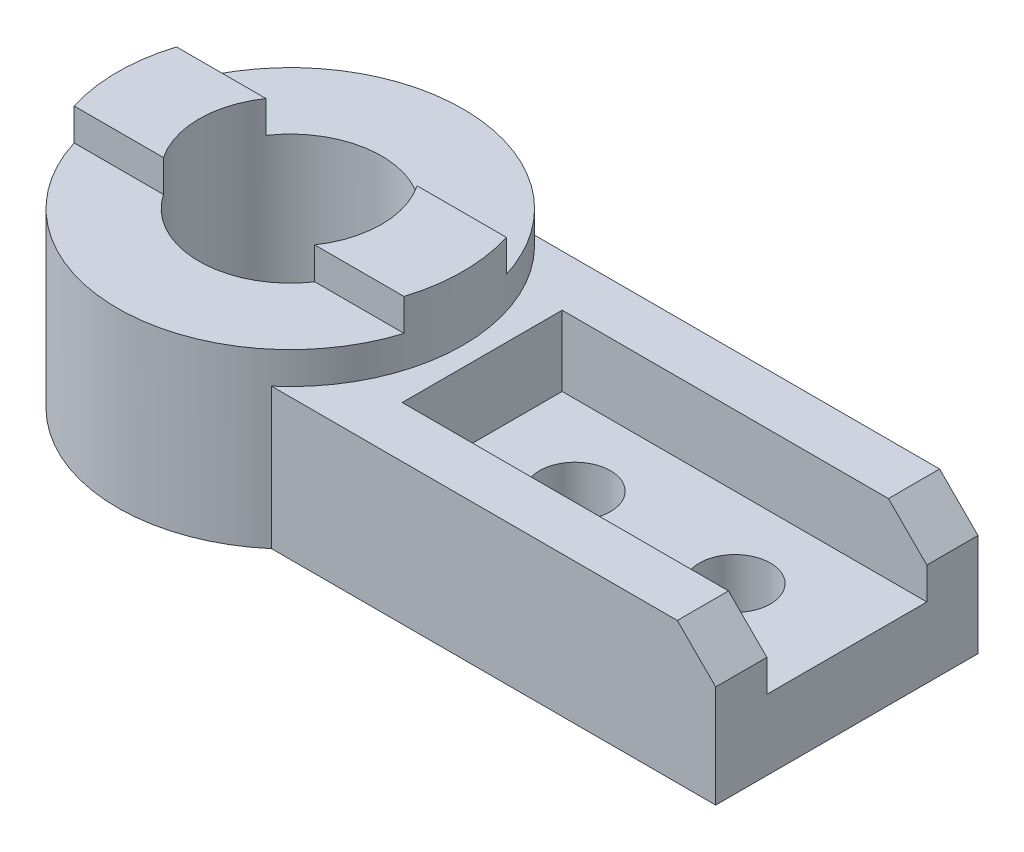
ISO-10303-21;
HEADER;
FILE_DESCRIPTION(('STEP AP214'),'2;1');
FILE_NAME('part.step','',(''),(''),'','','');
FILE_SCHEMA(('AUTOMOTIVE_DESIGN { 1 0 10303 214 1 1 1 1 }'));
ENDSEC;
DATA;
#1=APPLICATION_CONTEXT('core data for automotive mechanical design processes');
#2=APPLICATION_PROTOCOL_DEFINITION('international standard','automotive_design',2000,#1);
#3=PRODUCT_CONTEXT('',#1,'mechanical');
#4=PRODUCT('Part','Part','',(#3));
#5=PRODUCT_RELATED_PRODUCT_CATEGORY('part','',(#4));
#6=PRODUCT_DEFINITION_FORMATION('','',#4);
#7=PRODUCT_DEFINITION_CONTEXT('part definition',#1,'design');
#8=PRODUCT_DEFINITION('design','',#6,#7);
#9=PRODUCT_DEFINITION_SHAPE('','',#8);
#10=(LENGTH_UNIT() NAMED_UNIT(*) SI_UNIT(.MILLI.,.METRE.));
#11=(NAMED_UNIT(*) PLANE_ANGLE_UNIT() SI_UNIT($,.RADIAN.));
#12=(NAMED_UNIT(*) SI_UNIT($,.STERADIAN.) SOLID_ANGLE_UNIT());
#13=UNCERTAINTY_MEASURE_WITH_UNIT(LENGTH_MEASURE(1.E-05),#10,'distance_accuracy_value','');
#14=(GEOMETRIC_REPRESENTATION_CONTEXT(3) GLOBAL_UNCERTAINTY_ASSIGNED_CONTEXT((#13)) GLOBAL_UNIT_ASSIGNED_CONTEXT((#10,
#11,#12)) REPRESENTATION_CONTEXT('',''));
#15=CARTESIAN_POINT('',(0.,0.,0.));
#16=DIRECTION('',(0.,0.,1.));
#17=DIRECTION('',(1.,0.,0.));
#18=AXIS2_PLACEMENT_3D('',#15,#16,#17);
#19=CARTESIAN_POINT('',(0.,54.,0.));
#20=DIRECTION('',(0.,1.,0.));
#21=DIRECTION('',(0.,0.,1.));
#22=AXIS2_PLACEMENT_3D('',#19,#20,#21);
#23=PLANE('',#22);
#24=CARTESIAN_POINT('',(0.,54.,0.));
#25=DIRECTION('',(0.,1.,0.));
#26=DIRECTION('',(0.,0.,1.));
#27=AXIS2_PLACEMENT_3D('',#24,#25,#26);
#28=CIRCLE('',#27,28.55);
#29=CARTESIAN_POINT('',(-23.6453483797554,54.,16.));
#30=VERTEX_POINT('',#29);
#31=CARTESIAN_POINT('',(23.6453483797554,54.,16.));
#32=VERTEX_POINT('',#31);
#33=EDGE_CURVE('E216',#30,#32,#28,.T.);
#34=ORIENTED_EDGE('',*,*,#33,.F.);
#35=DIRECTION('',(1.,0.,0.));
#36=VECTOR('',#35,1.);
#37=CARTESIAN_POINT('',(-23.6453483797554,54.,16.));
#38=LINE('',#37,#36);
#39=CARTESIAN_POINT('',(-51.5751878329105,54.,16.));
#40=VERTEX_POINT('',#39);
#41=EDGE_CURVE('E572',#40,#30,#38,.T.);
#42=ORIENTED_EDGE('',*,*,#41,.F.);
#43=CARTESIAN_POINT('',(0.,54.,0.));
#44=DIRECTION('',(0.,1.,0.));
#45=DIRECTION('',(0.,0.,1.));
#46=AXIS2_PLACEMENT_3D('',#43,#44,#45);
#47=CIRCLE('',#46,54.);
#48=CARTESIAN_POINT('',(51.5751878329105,54.,16.));
#49=VERTEX_POINT('',#48);
#50=EDGE_CURVE('E182',#40,#49,#47,.T.);
#51=ORIENTED_EDGE('',*,*,#50,.T.);
#52=DIRECTION('',(1.,0.,0.));
#53=VECTOR('',#52,1.);
#54=CARTESIAN_POINT('',(51.5751878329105,54.,16.));
#55=LINE('',#54,#53);
#56=EDGE_CURVE('E183',#32,#49,#55,.T.);
#57=ORIENTED_EDGE('',*,*,#56,.F.);
#58=EDGE_LOOP('',(#34,#42,#51,#57));
#59=FACE_BOUND('',#58,.T.);
#60=ADVANCED_FACE('F33',(#59),#23,.T.);
#61=CARTESIAN_POINT('',(51.5751878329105,54.,-16.));
#62=VERTEX_POINT('',#61);
#63=CARTESIAN_POINT('',(-51.5751878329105,54.,-16.));
#64=VERTEX_POINT('',#63);
#65=EDGE_CURVE('E219',#62,#64,#47,.T.);
#66=ORIENTED_EDGE('',*,*,#65,.T.);
#67=DIRECTION('',(-1.,0.,0.));
#68=VECTOR('',#67,1.);
#69=CARTESIAN_POINT('',(-23.6453483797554,54.,-16.));
#70=LINE('',#69,#68);
#71=CARTESIAN_POINT('',(-23.6453483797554,54.,-16.));
#72=VERTEX_POINT('',#71);
#73=EDGE_CURVE('E175',#72,#64,#70,.T.);
#74=ORIENTED_EDGE('',*,*,#73,.F.);
#75=CARTESIAN_POINT('',(23.6453483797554,54.,-16.));
#76=VERTEX_POINT('',#75);
#77=EDGE_CURVE('E56',#76,#72,#28,.T.);
#78=ORIENTED_EDGE('',*,*,#77,.F.);
#79=DIRECTION('',(-1.,0.,0.));
#80=VECTOR('',#79,1.);
#81=CARTESIAN_POINT('',(51.5751878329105,54.,-16.));
#82=LINE('',#81,#80);
#83=EDGE_CURVE('E186',#62,#76,#82,.T.);
#84=ORIENTED_EDGE('',*,*,#83,.F.);
#85=EDGE_LOOP('',(#66,#74,#78,#84));
#86=FACE_BOUND('',#85,.T.);
#87=ADVANCED_FACE('F363',(#86),#23,.T.);
#88=CARTESIAN_POINT('',(89.,44.,0.));
#89=DIRECTION('',(0.,-1.,0.));
#90=DIRECTION('',(0.,0.,-1.));
#91=AXIS2_PLACEMENT_3D('',#88,#89,#90);
#92=CYLINDRICAL_SURFACE('',#91,11.1);
#93=CARTESIAN_POINT('',(89.,0.,0.));
#94=DIRECTION('',(0.,1.,0.));
#95=DIRECTION('',(0.,0.,1.));
#96=AXIS2_PLACEMENT_3D('',#93,#94,#95);
#97=CIRCLE('',#96,11.1);
#98=CARTESIAN_POINT('',(89.,0.,11.1));
#99=VERTEX_POINT('',#98);
#100=EDGE_CURVE('E274',#99,#99,#97,.T.);
#101=ORIENTED_EDGE('',*,*,#100,.F.);
#102=EDGE_LOOP('',(#101));
#103=FACE_BOUND('',#102,.T.);
#104=CARTESIAN_POINT('',(89.,22.,0.));
#105=DIRECTION('',(0.,1.,0.));
#106=DIRECTION('',(0.,0.,1.));
#107=AXIS2_PLACEMENT_3D('',#104,#105,#106);
#108=CIRCLE('',#107,11.1);
#109=CARTESIAN_POINT('',(89.,22.,11.1));
#110=VERTEX_POINT('',#109);
#111=EDGE_CURVE('E268',#110,#110,#108,.T.);
#112=ORIENTED_EDGE('',*,*,#111,.T.);
#113=EDGE_LOOP('',(#112));
#114=FACE_BOUND('',#113,.T.);
#115=ADVANCED_FACE('F369',(#103,#114),#92,.F.);
#116=CARTESIAN_POINT('',(139.,44.,0.));
#117=DIRECTION('',(0.,-1.,0.));
#118=DIRECTION('',(0.,0.,-1.));
#119=AXIS2_PLACEMENT_3D('',#116,#117,#118);
#120=CYLINDRICAL_SURFACE('',#119,11.1);
#121=CARTESIAN_POINT('',(139.,0.,0.));
#122=DIRECTION('',(0.,1.,0.));
#123=DIRECTION('',(0.,0.,1.));
#124=AXIS2_PLACEMENT_3D('',#121,#122,#123);
#125=CIRCLE('',#124,11.1);
#126=CARTESIAN_POINT('',(139.,0.,11.1));
#127=VERTEX_POINT('',#126);
#128=EDGE_CURVE('E271',#127,#127,#125,.T.);
#129=ORIENTED_EDGE('',*,*,#128,.F.);
#130=EDGE_LOOP('',(#129));
#131=FACE_BOUND('',#130,.T.);
#132=CARTESIAN_POINT('',(139.,22.,0.));
#133=DIRECTION('',(0.,1.,0.));
#134=DIRECTION('',(0.,0.,1.));
#135=AXIS2_PLACEMENT_3D('',#132,#133,#134);
#136=CIRCLE('',#135,11.1);
#137=CARTESIAN_POINT('',(139.,22.,11.1));
#138=VERTEX_POINT('',#137);
#139=EDGE_CURVE('E260',#138,#138,#136,.T.);
#140=ORIENTED_EDGE('',*,*,#139,.T.);
#141=EDGE_LOOP('',(#140));
#142=FACE_BOUND('',#141,.T.);
#143=ADVANCED_FACE('F305',(#131,#142),#120,.F.);
#144=CARTESIAN_POINT('',(0.,44.,0.));
#145=DIRECTION('',(0.,1.,0.));
#146=DIRECTION('',(0.,0.,1.));
#147=AXIS2_PLACEMENT_3D('',#144,#145,#146);
#148=PLANE('',#147);
#149=DIRECTION('',(0.,0.,1.));
#150=VECTOR('',#149,1.);
#151=CARTESIAN_POINT('',(162.,44.,-41.));
#152=LINE('',#151,#150);
#153=CARTESIAN_POINT('',(162.,44.,-41.));
#154=VERTEX_POINT('',#153);
#155=CARTESIAN_POINT('',(162.,44.,-25.));
#156=VERTEX_POINT('',#155);
#157=EDGE_CURVE('E234',#154,#156,#152,.T.);
#158=ORIENTED_EDGE('',*,*,#157,.F.);
#159=DIRECTION('',(-1.,0.,0.));
#160=VECTOR('',#159,1.);
#161=CARTESIAN_POINT('',(174.,44.,-41.));
#162=LINE('',#161,#160);
#163=CARTESIAN_POINT('',(35.1425667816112,44.,-41.));
#164=VERTEX_POINT('',#163);
#165=EDGE_CURVE('E278',#154,#164,#162,.T.);
#166=ORIENTED_EDGE('',*,*,#165,.T.);
#167=CARTESIAN_POINT('',(0.,44.,0.));
#168=DIRECTION('',(0.,-1.,0.));
#169=DIRECTION('',(0.,0.,1.));
#170=AXIS2_PLACEMENT_3D('',#167,#168,#169);
#171=CIRCLE('',#170,54.);
#172=CARTESIAN_POINT('',(35.1425667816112,44.,41.));
#173=VERTEX_POINT('',#172);
#174=EDGE_CURVE('E281',#164,#173,#171,.T.);
#175=ORIENTED_EDGE('',*,*,#174,.T.);
#176=DIRECTION('',(1.,0.,0.));
#177=VECTOR('',#176,1.);
#178=CARTESIAN_POINT('',(174.,44.,41.));
#179=LINE('',#178,#177);
#180=CARTESIAN_POINT('',(162.,44.,41.));
#181=VERTEX_POINT('',#180);
#182=EDGE_CURVE('E285',#173,#181,#179,.T.);
#183=ORIENTED_EDGE('',*,*,#182,.T.);
#184=CARTESIAN_POINT('',(162.,44.,25.));
#185=VERTEX_POINT('',#184);
#186=EDGE_CURVE('E227',#185,#181,#152,.T.);
#187=ORIENTED_EDGE('',*,*,#186,.F.);
#188=DIRECTION('',(1.,0.,0.));
#189=VECTOR('',#188,1.);
#190=CARTESIAN_POINT('',(59.9999999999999,44.,25.));
#191=LINE('',#190,#189);
#192=CARTESIAN_POINT('',(59.9999999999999,44.,25.));
#193=VERTEX_POINT('',#192);
#194=EDGE_CURVE('E253',#193,#185,#191,.T.);
#195=ORIENTED_EDGE('',*,*,#194,.F.);
#196=DIRECTION('',(0.,0.,1.));
#197=VECTOR('',#196,1.);
#198=CARTESIAN_POINT('',(60.,44.,-25.));
#199=LINE('',#198,#197);
#200=CARTESIAN_POINT('',(60.,44.,-25.));
#201=VERTEX_POINT('',#200);
#202=EDGE_CURVE('E238',#201,#193,#199,.T.);
#203=ORIENTED_EDGE('',*,*,#202,.F.);
#204=DIRECTION('',(-1.,0.,0.));
#205=VECTOR('',#204,1.);
#206=CARTESIAN_POINT('',(60.,44.,-25.));
#207=LINE('',#206,#205);
#208=EDGE_CURVE('E243',#156,#201,#207,.T.);
#209=ORIENTED_EDGE('',*,*,#208,.F.);
#210=EDGE_LOOP('',(#158,#166,#175,#183,#187,#195,#203,#209));
#211=FACE_BOUND('',#210,.T.);
#212=ADVANCED_FACE('F334',(#211),#148,.T.);
#213=CARTESIAN_POINT('',(0.,0.,0.));
#214=DIRECTION('',(0.,1.,0.));
#215=DIRECTION('',(0.,0.,1.));
#216=AXIS2_PLACEMENT_3D('',#213,#214,#215);
#217=PLANE('',#216);
#218=DIRECTION('',(-1.,0.,0.));
#219=VECTOR('',#218,1.);
#220=CARTESIAN_POINT('',(174.,0.,-41.));
#221=LINE('',#220,#219);
#222=CARTESIAN_POINT('',(174.,0.,-41.));
#223=VERTEX_POINT('',#222);
#224=CARTESIAN_POINT('',(35.1425667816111,0.,-41.));
#225=VERTEX_POINT('',#224);
#226=EDGE_CURVE('E277',#223,#225,#221,.T.);
#227=ORIENTED_EDGE('',*,*,#226,.F.);
#228=DIRECTION('',(0.,0.,-1.));
#229=VECTOR('',#228,1.);
#230=CARTESIAN_POINT('',(174.,0.,41.));
#231=LINE('',#230,#229);
#232=CARTESIAN_POINT('',(174.,0.,41.));
#233=VERTEX_POINT('',#232);
#234=EDGE_CURVE('E282',#233,#223,#231,.T.);
#235=ORIENTED_EDGE('',*,*,#234,.F.);
#236=DIRECTION('',(1.,0.,0.));
#237=VECTOR('',#236,1.);
#238=CARTESIAN_POINT('',(174.,0.,41.));
#239=LINE('',#238,#237);
#240=CARTESIAN_POINT('',(35.1425667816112,0.,41.));
#241=VERTEX_POINT('',#240);
#242=EDGE_CURVE('E291',#241,#233,#239,.T.);
#243=ORIENTED_EDGE('',*,*,#242,.F.);
#244=CARTESIAN_POINT('',(0.,0.,0.));
#245=DIRECTION('',(0.,1.,0.));
#246=DIRECTION('',(0.,0.,1.));
#247=AXIS2_PLACEMENT_3D('',#244,#245,#246);
#248=CIRCLE('',#247,54.);
#249=EDGE_CURVE('E215',#225,#241,#248,.T.);
#250=ORIENTED_EDGE('',*,*,#249,.F.);
#251=EDGE_LOOP('',(#227,#235,#243,#250));
#252=FACE_BOUND('',#251,.T.);
#253=ORIENTED_EDGE('',*,*,#100,.T.);
#254=EDGE_LOOP('',(#253));
#255=FACE_BOUND('',#254,.T.);
#256=ORIENTED_EDGE('',*,*,#128,.T.);
#257=EDGE_LOOP('',(#256));
#258=FACE_BOUND('',#257,.T.);
#259=CARTESIAN_POINT('',(0.,0.,0.));
#260=DIRECTION('',(0.,1.,0.));
#261=DIRECTION('',(0.,0.,1.));
#262=AXIS2_PLACEMENT_3D('',#259,#260,#261);
#263=CIRCLE('',#262,28.55);
#264=CARTESIAN_POINT('',(0.,0.,28.55));
#265=VERTEX_POINT('',#264);
#266=EDGE_CURVE('E213',#265,#265,#263,.T.);
#267=ORIENTED_EDGE('',*,*,#266,.T.);
#268=EDGE_LOOP('',(#267));
#269=FACE_BOUND('',#268,.T.);
#270=ADVANCED_FACE('F348',(#252,#255,#258,#269),#217,.F.);
#271=CARTESIAN_POINT('',(174.,44.,-41.));
#272=DIRECTION('',(0.,0.,1.));
#273=DIRECTION('',(1.,0.,0.));
#274=AXIS2_PLACEMENT_3D('',#271,#272,#273);
#275=PLANE('',#274);
#276=ORIENTED_EDGE('',*,*,#165,.F.);
#277=DIRECTION('',(0.707106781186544,-0.707106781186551,0.));
#278=VECTOR('',#277,1.);
#279=CARTESIAN_POINT('',(174.,31.9999999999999,-41.));
#280=LINE('',#279,#278);
#281=CARTESIAN_POINT('',(174.,31.9999999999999,-41.));
#282=VERTEX_POINT('',#281);
#283=EDGE_CURVE('E224',#154,#282,#280,.T.);
#284=ORIENTED_EDGE('',*,*,#283,.T.);
#285=DIRECTION('',(0.,-1.,0.));
#286=VECTOR('',#285,1.);
#287=CARTESIAN_POINT('',(174.,44.,-41.));
#288=LINE('',#287,#286);
#289=EDGE_CURVE('E288',#282,#223,#288,.T.);
#290=ORIENTED_EDGE('',*,*,#289,.T.);
#291=ORIENTED_EDGE('',*,*,#226,.T.);
#292=DIRECTION('',(0.,-1.,0.));
#293=VECTOR('',#292,1.);
#294=CARTESIAN_POINT('',(35.1425667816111,44.,-41.));
#295=LINE('',#294,#293);
#296=EDGE_CURVE('E41',#164,#225,#295,.T.);
#297=ORIENTED_EDGE('',*,*,#296,.F.);
#298=EDGE_LOOP('',(#276,#284,#290,#291,#297));
#299=FACE_BOUND('',#298,.T.);
#300=ADVANCED_FACE('F35',(#299),#275,.F.);
#301=CARTESIAN_POINT('',(174.,44.,41.));
#302=DIRECTION('',(0.,0.,-1.));
#303=DIRECTION('',(-1.,0.,0.));
#304=AXIS2_PLACEMENT_3D('',#301,#302,#303);
#305=PLANE('',#304);
#306=DIRECTION('',(0.,-1.,0.));
#307=VECTOR('',#306,1.);
#308=CARTESIAN_POINT('',(174.,44.,41.));
#309=LINE('',#308,#307);
#310=CARTESIAN_POINT('',(174.,31.9999999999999,41.));
#311=VERTEX_POINT('',#310);
#312=EDGE_CURVE('E297',#311,#233,#309,.T.);
#313=ORIENTED_EDGE('',*,*,#312,.F.);
#314=DIRECTION('',(0.707106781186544,-0.707106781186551,0.));
#315=VECTOR('',#314,1.);
#316=CARTESIAN_POINT('',(174.,31.9999999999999,41.));
#317=LINE('',#316,#315);
#318=EDGE_CURVE('E222',#181,#311,#317,.T.);
#319=ORIENTED_EDGE('',*,*,#318,.F.);
#320=ORIENTED_EDGE('',*,*,#182,.F.);
#321=DIRECTION('',(0.,-1.,0.));
#322=VECTOR('',#321,1.);
#323=CARTESIAN_POINT('',(35.1425667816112,44.,41.));
#324=LINE('',#323,#322);
#325=EDGE_CURVE('E299',#173,#241,#324,.T.);
#326=ORIENTED_EDGE('',*,*,#325,.T.);
#327=ORIENTED_EDGE('',*,*,#242,.T.);
#328=EDGE_LOOP('',(#313,#319,#320,#326,#327));
#329=FACE_BOUND('',#328,.T.);
#330=ADVANCED_FACE('F342',(#329),#305,.F.);
#331=CARTESIAN_POINT('',(174.,44.,41.));
#332=DIRECTION('',(-1.,0.,0.));
#333=DIRECTION('',(0.,0.,1.));
#334=AXIS2_PLACEMENT_3D('',#331,#332,#333);
#335=PLANE('',#334);
#336=ORIENTED_EDGE('',*,*,#289,.F.);
#337=DIRECTION('',(0.,0.,1.));
#338=VECTOR('',#337,1.);
#339=CARTESIAN_POINT('',(174.,31.9999999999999,-41.));
#340=LINE('',#339,#338);
#341=CARTESIAN_POINT('',(174.,31.9999999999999,-25.));
#342=VERTEX_POINT('',#341);
#343=EDGE_CURVE('E229',#282,#342,#340,.T.);
#344=ORIENTED_EDGE('',*,*,#343,.T.);
#345=DIRECTION('',(0.,1.,0.));
#346=VECTOR('',#345,1.);
#347=CARTESIAN_POINT('',(174.,22.,-25.));
#348=LINE('',#347,#346);
#349=CARTESIAN_POINT('',(174.,22.,-25.));
#350=VERTEX_POINT('',#349);
#351=EDGE_CURVE('E261',#350,#342,#348,.T.);
#352=ORIENTED_EDGE('',*,*,#351,.F.);
#353=DIRECTION('',(0.,0.,-1.));
#354=VECTOR('',#353,1.);
#355=CARTESIAN_POINT('',(174.,22.,-25.));
#356=LINE('',#355,#354);
#357=CARTESIAN_POINT('',(174.,22.,25.));
#358=VERTEX_POINT('',#357);
#359=EDGE_CURVE('E245',#358,#350,#356,.T.);
#360=ORIENTED_EDGE('',*,*,#359,.F.);
#361=DIRECTION('',(0.,1.,0.));
#362=VECTOR('',#361,1.);
#363=CARTESIAN_POINT('',(174.,22.,25.));
#364=LINE('',#363,#362);
#365=CARTESIAN_POINT('',(174.,31.9999999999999,25.));
#366=VERTEX_POINT('',#365);
#367=EDGE_CURVE('E264',#358,#366,#364,.T.);
#368=ORIENTED_EDGE('',*,*,#367,.T.);
#369=EDGE_CURVE('E233',#366,#311,#340,.T.);
#370=ORIENTED_EDGE('',*,*,#369,.T.);
#371=ORIENTED_EDGE('',*,*,#312,.T.);
#372=ORIENTED_EDGE('',*,*,#234,.T.);
#373=EDGE_LOOP('',(#336,#344,#352,#360,#368,#370,#371,#372));
#374=FACE_BOUND('',#373,.T.);
#375=ADVANCED_FACE('F328',(#374),#335,.F.);
#376=CARTESIAN_POINT('',(60.,22.,-25.));
#377=DIRECTION('',(-1.,0.,0.));
#378=DIRECTION('',(0.,0.,1.));
#379=AXIS2_PLACEMENT_3D('',#376,#377,#378);
#380=PLANE('',#379);
#381=ORIENTED_EDGE('',*,*,#202,.T.);
#382=DIRECTION('',(0.,1.,0.));
#383=VECTOR('',#382,1.);
#384=CARTESIAN_POINT('',(59.9999999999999,22.,25.));
#385=LINE('',#384,#383);
#386=CARTESIAN_POINT('',(59.9999999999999,22.,25.));
#387=VERTEX_POINT('',#386);
#388=EDGE_CURVE('E250',#387,#193,#385,.T.);
#389=ORIENTED_EDGE('',*,*,#388,.F.);
#390=DIRECTION('',(0.,0.,1.));
#391=VECTOR('',#390,1.);
#392=CARTESIAN_POINT('',(60.,22.,-25.));
#393=LINE('',#392,#391);
#394=CARTESIAN_POINT('',(60.,22.,-25.));
#395=VERTEX_POINT('',#394);
#396=EDGE_CURVE('E239',#395,#387,#393,.T.);
#397=ORIENTED_EDGE('',*,*,#396,.F.);
#398=DIRECTION('',(0.,1.,0.));
#399=VECTOR('',#398,1.);
#400=CARTESIAN_POINT('',(60.,22.,-25.));
#401=LINE('',#400,#399);
#402=EDGE_CURVE('E257',#395,#201,#401,.T.);
#403=ORIENTED_EDGE('',*,*,#402,.T.);
#404=EDGE_LOOP('',(#381,#389,#397,#403));
#405=FACE_BOUND('',#404,.T.);
#406=ADVANCED_FACE('F319',(#405),#380,.F.);
#407=CARTESIAN_POINT('',(60.,22.,-25.));
#408=DIRECTION('',(0.,0.,-1.));
#409=DIRECTION('',(-1.,0.,0.));
#410=AXIS2_PLACEMENT_3D('',#407,#408,#409);
#411=PLANE('',#410);
#412=ORIENTED_EDGE('',*,*,#351,.T.);
#413=DIRECTION('',(-0.707106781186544,0.707106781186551,0.));
#414=VECTOR('',#413,1.);
#415=CARTESIAN_POINT('',(122.000000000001,83.9999999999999,-25.));
#416=LINE('',#415,#414);
#417=EDGE_CURVE('E232',#342,#156,#416,.T.);
#418=ORIENTED_EDGE('',*,*,#417,.T.);
#419=ORIENTED_EDGE('',*,*,#208,.T.);
#420=ORIENTED_EDGE('',*,*,#402,.F.);
#421=DIRECTION('',(-1.,0.,0.));
#422=VECTOR('',#421,1.);
#423=CARTESIAN_POINT('',(60.,22.,-25.));
#424=LINE('',#423,#422);
#425=EDGE_CURVE('E247',#350,#395,#424,.T.);
#426=ORIENTED_EDGE('',*,*,#425,.F.);
#427=EDGE_LOOP('',(#412,#418,#419,#420,#426));
#428=FACE_BOUND('',#427,.T.);
#429=ADVANCED_FACE('F330',(#428),#411,.F.);
#430=CARTESIAN_POINT('',(59.9999999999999,22.,25.));
#431=DIRECTION('',(0.,0.,1.));
#432=DIRECTION('',(1.,0.,0.));
#433=AXIS2_PLACEMENT_3D('',#430,#431,#432);
#434=PLANE('',#433);
#435=ORIENTED_EDGE('',*,*,#194,.T.);
#436=DIRECTION('',(0.707106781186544,-0.707106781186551,0.));
#437=VECTOR('',#436,1.);
#438=CARTESIAN_POINT('',(122.000000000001,83.9999999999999,25.));
#439=LINE('',#438,#437);
#440=EDGE_CURVE('E11',#185,#366,#439,.T.);
#441=ORIENTED_EDGE('',*,*,#440,.T.);
#442=ORIENTED_EDGE('',*,*,#367,.F.);
#443=DIRECTION('',(1.,0.,0.));
#444=VECTOR('',#443,1.);
#445=CARTESIAN_POINT('',(59.9999999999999,22.,25.));
#446=LINE('',#445,#444);
#447=EDGE_CURVE('E242',#387,#358,#446,.T.);
#448=ORIENTED_EDGE('',*,*,#447,.F.);
#449=ORIENTED_EDGE('',*,*,#388,.T.);
#450=EDGE_LOOP('',(#435,#441,#442,#448,#449));
#451=FACE_BOUND('',#450,.T.);
#452=ADVANCED_FACE('F311',(#451),#434,.F.);
#453=CARTESIAN_POINT('',(0.,22.,0.));
#454=DIRECTION('',(0.,1.,0.));
#455=DIRECTION('',(0.,0.,1.));
#456=AXIS2_PLACEMENT_3D('',#453,#454,#455);
#457=PLANE('',#456);
#458=ORIENTED_EDGE('',*,*,#111,.F.);
#459=EDGE_LOOP('',(#458));
#460=FACE_BOUND('',#459,.T.);
#461=ORIENTED_EDGE('',*,*,#139,.F.);
#462=EDGE_LOOP('',(#461));
#463=FACE_BOUND('',#462,.T.);
#464=ORIENTED_EDGE('',*,*,#396,.T.);
#465=ORIENTED_EDGE('',*,*,#447,.T.);
#466=ORIENTED_EDGE('',*,*,#359,.T.);
#467=ORIENTED_EDGE('',*,*,#425,.T.);
#468=EDGE_LOOP('',(#464,#465,#466,#467));
#469=FACE_BOUND('',#468,.T.);
#470=ADVANCED_FACE('F307',(#460,#463,#469),#457,.T.);
#471=CARTESIAN_POINT('',(174.,31.9999999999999,-41.));
#472=DIRECTION('',(-0.707106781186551,-0.707106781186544,0.));
#473=DIRECTION('',(0.707106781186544,-0.707106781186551,0.));
#474=AXIS2_PLACEMENT_3D('',#471,#472,#473);
#475=PLANE('',#474);
#476=ORIENTED_EDGE('',*,*,#186,.T.);
#477=ORIENTED_EDGE('',*,*,#318,.T.);
#478=ORIENTED_EDGE('',*,*,#369,.F.);
#479=ORIENTED_EDGE('',*,*,#440,.F.);
#480=EDGE_LOOP('',(#476,#477,#478,#479));
#481=FACE_BOUND('',#480,.T.);
#482=ADVANCED_FACE('F310',(#481),#475,.F.);
#483=ORIENTED_EDGE('',*,*,#343,.F.);
#484=ORIENTED_EDGE('',*,*,#283,.F.);
#485=ORIENTED_EDGE('',*,*,#157,.T.);
#486=ORIENTED_EDGE('',*,*,#417,.F.);
#487=EDGE_LOOP('',(#483,#484,#485,#486));
#488=FACE_BOUND('',#487,.T.);
#489=ADVANCED_FACE('F353',(#488),#475,.F.);
#490=CARTESIAN_POINT('',(0.,54.,0.));
#491=DIRECTION('',(0.,-1.,0.));
#492=DIRECTION('',(0.,0.,-1.));
#493=AXIS2_PLACEMENT_3D('',#490,#491,#492);
#494=CYLINDRICAL_SURFACE('',#493,54.);
#495=ORIENTED_EDGE('',*,*,#65,.F.);
#496=DIRECTION('',(0.,-1.,0.));
#497=VECTOR('',#496,1.);
#498=CARTESIAN_POINT('',(51.5751878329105,64.,-16.));
#499=LINE('',#498,#497);
#500=CARTESIAN_POINT('',(51.5751878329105,64.,-16.));
#501=VERTEX_POINT('',#500);
#502=EDGE_CURVE('E205',#501,#62,#499,.T.);
#503=ORIENTED_EDGE('',*,*,#502,.F.);
#504=CARTESIAN_POINT('',(0.,64.,0.));
#505=DIRECTION('',(0.,1.,0.));
#506=DIRECTION('',(0.,0.,1.));
#507=AXIS2_PLACEMENT_3D('',#504,#505,#506);
#508=CIRCLE('',#507,54.);
#509=CARTESIAN_POINT('',(51.5751878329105,64.,16.));
#510=VERTEX_POINT('',#509);
#511=EDGE_CURVE('E197',#510,#501,#508,.T.);
#512=ORIENTED_EDGE('',*,*,#511,.F.);
#513=DIRECTION('',(0.,-1.,0.));
#514=VECTOR('',#513,1.);
#515=CARTESIAN_POINT('',(51.5751878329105,64.,16.));
#516=LINE('',#515,#514);
#517=EDGE_CURVE('E208',#510,#49,#516,.T.);
#518=ORIENTED_EDGE('',*,*,#517,.T.);
#519=ORIENTED_EDGE('',*,*,#50,.F.);
#520=DIRECTION('',(0.,-1.,0.));
#521=VECTOR('',#520,1.);
#522=CARTESIAN_POINT('',(-51.5751878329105,64.,16.));
#523=LINE('',#522,#521);
#524=CARTESIAN_POINT('',(-51.5751878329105,64.,16.));
#525=VERTEX_POINT('',#524);
#526=EDGE_CURVE('E162',#525,#40,#523,.T.);
#527=ORIENTED_EDGE('',*,*,#526,.F.);
#528=CARTESIAN_POINT('',(0.,64.,0.));
#529=DIRECTION('',(0.,1.,0.));
#530=DIRECTION('',(0.,0.,1.));
#531=AXIS2_PLACEMENT_3D('',#528,#529,#530);
#532=CIRCLE('',#531,54.);
#533=CARTESIAN_POINT('',(-51.5751878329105,64.,-16.));
#534=VERTEX_POINT('',#533);
#535=EDGE_CURVE('E166',#534,#525,#532,.T.);
#536=ORIENTED_EDGE('',*,*,#535,.F.);
#537=DIRECTION('',(0.,-1.,0.));
#538=VECTOR('',#537,1.);
#539=CARTESIAN_POINT('',(-51.5751878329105,64.,-16.));
#540=LINE('',#539,#538);
#541=EDGE_CURVE('E570',#534,#64,#540,.T.);
#542=ORIENTED_EDGE('',*,*,#541,.T.);
#543=EDGE_LOOP('',(#495,#503,#512,#518,#519,#527,#536,#542));
#544=FACE_BOUND('',#543,.T.);
#545=ORIENTED_EDGE('',*,*,#174,.F.);
#546=ORIENTED_EDGE('',*,*,#296,.T.);
#547=ORIENTED_EDGE('',*,*,#249,.T.);
#548=ORIENTED_EDGE('',*,*,#325,.F.);
#549=EDGE_LOOP('',(#545,#546,#547,#548));
#550=FACE_BOUND('',#549,.T.);
#551=ADVANCED_FACE('F179',(#544,#550),#494,.T.);
#552=CARTESIAN_POINT('',(0.,54.,0.));
#553=DIRECTION('',(0.,-1.,0.));
#554=DIRECTION('',(0.,0.,-1.));
#555=AXIS2_PLACEMENT_3D('',#552,#553,#554);
#556=CYLINDRICAL_SURFACE('',#555,28.55);
#557=ORIENTED_EDGE('',*,*,#77,.T.);
#558=DIRECTION('',(0.,-1.,0.));
#559=VECTOR('',#558,1.);
#560=CARTESIAN_POINT('',(-23.6453483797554,64.,-16.));
#561=LINE('',#560,#559);
#562=CARTESIAN_POINT('',(-23.6453483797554,64.,-16.));
#563=VERTEX_POINT('',#562);
#564=EDGE_CURVE('E188',#563,#72,#561,.T.);
#565=ORIENTED_EDGE('',*,*,#564,.F.);
#566=CARTESIAN_POINT('',(0.,64.,0.));
#567=DIRECTION('',(0.,-1.,0.));
#568=DIRECTION('',(0.,0.,1.));
#569=AXIS2_PLACEMENT_3D('',#566,#567,#568);
#570=CIRCLE('',#569,28.55);
#571=CARTESIAN_POINT('',(-23.6453483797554,64.,16.));
#572=VERTEX_POINT('',#571);
#573=EDGE_CURVE('E165',#572,#563,#570,.T.);
#574=ORIENTED_EDGE('',*,*,#573,.F.);
#575=DIRECTION('',(0.,-1.,0.));
#576=VECTOR('',#575,1.);
#577=CARTESIAN_POINT('',(-23.6453483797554,64.,16.));
#578=LINE('',#577,#576);
#579=EDGE_CURVE('E48',#572,#30,#578,.T.);
#580=ORIENTED_EDGE('',*,*,#579,.T.);
#581=ORIENTED_EDGE('',*,*,#33,.T.);
#582=DIRECTION('',(0.,-1.,0.));
#583=VECTOR('',#582,1.);
#584=CARTESIAN_POINT('',(23.6453483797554,64.,16.));
#585=LINE('',#584,#583);
#586=CARTESIAN_POINT('',(23.6453483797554,64.,16.));
#587=VERTEX_POINT('',#586);
#588=EDGE_CURVE('E210',#587,#32,#585,.T.);
#589=ORIENTED_EDGE('',*,*,#588,.F.);
#590=CARTESIAN_POINT('',(0.,64.,0.));
#591=DIRECTION('',(0.,-1.,0.));
#592=DIRECTION('',(0.,0.,1.));
#593=AXIS2_PLACEMENT_3D('',#590,#591,#592);
#594=CIRCLE('',#593,28.55);
#595=CARTESIAN_POINT('',(23.6453483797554,64.,-16.));
#596=VERTEX_POINT('',#595);
#597=EDGE_CURVE('E192',#596,#587,#594,.T.);
#598=ORIENTED_EDGE('',*,*,#597,.F.);
#599=DIRECTION('',(0.,-1.,0.));
#600=VECTOR('',#599,1.);
#601=CARTESIAN_POINT('',(23.6453483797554,64.,-16.));
#602=LINE('',#601,#600);
#603=EDGE_CURVE('E200',#596,#76,#602,.T.);
#604=ORIENTED_EDGE('',*,*,#603,.T.);
#605=EDGE_LOOP('',(#557,#565,#574,#580,#581,#589,#598,#604));
#606=FACE_BOUND('',#605,.T.);
#607=ORIENTED_EDGE('',*,*,#266,.F.);
#608=EDGE_LOOP('',(#607));
#609=FACE_BOUND('',#608,.T.);
#610=ADVANCED_FACE('F360',(#606,#609),#556,.F.);
#611=CARTESIAN_POINT('',(51.5751878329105,64.,16.));
#612=DIRECTION('',(0.,0.,-1.));
#613=DIRECTION('',(-1.,0.,0.));
#614=AXIS2_PLACEMENT_3D('',#611,#612,#613);
#615=PLANE('',#614);
#616=ORIENTED_EDGE('',*,*,#56,.T.);
#617=ORIENTED_EDGE('',*,*,#517,.F.);
#618=DIRECTION('',(1.,0.,0.));
#619=VECTOR('',#618,1.);
#620=CARTESIAN_POINT('',(51.5751878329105,64.,16.));
#621=LINE('',#620,#619);
#622=EDGE_CURVE('E195',#587,#510,#621,.T.);
#623=ORIENTED_EDGE('',*,*,#622,.F.);
#624=ORIENTED_EDGE('',*,*,#588,.T.);
#625=EDGE_LOOP('',(#616,#617,#623,#624));
#626=FACE_BOUND('',#625,.T.);
#627=ADVANCED_FACE('F374',(#626),#615,.F.);
#628=CARTESIAN_POINT('',(51.5751878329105,64.,-16.));
#629=DIRECTION('',(0.,0.,1.));
#630=DIRECTION('',(1.,0.,0.));
#631=AXIS2_PLACEMENT_3D('',#628,#629,#630);
#632=PLANE('',#631);
#633=ORIENTED_EDGE('',*,*,#83,.T.);
#634=ORIENTED_EDGE('',*,*,#603,.F.);
#635=DIRECTION('',(-1.,0.,0.));
#636=VECTOR('',#635,1.);
#637=CARTESIAN_POINT('',(51.5751878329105,64.,-16.));
#638=LINE('',#637,#636);
#639=EDGE_CURVE('E199',#501,#596,#638,.T.);
#640=ORIENTED_EDGE('',*,*,#639,.F.);
#641=ORIENTED_EDGE('',*,*,#502,.T.);
#642=EDGE_LOOP('',(#633,#634,#640,#641));
#643=FACE_BOUND('',#642,.T.);
#644=ADVANCED_FACE('F377',(#643),#632,.F.);
#645=CARTESIAN_POINT('',(0.,64.,0.));
#646=DIRECTION('',(0.,1.,0.));
#647=DIRECTION('',(0.,0.,1.));
#648=AXIS2_PLACEMENT_3D('',#645,#646,#647);
#649=PLANE('',#648);
#650=ORIENTED_EDGE('',*,*,#597,.T.);
#651=ORIENTED_EDGE('',*,*,#622,.T.);
#652=ORIENTED_EDGE('',*,*,#511,.T.);
#653=ORIENTED_EDGE('',*,*,#639,.T.);
#654=EDGE_LOOP('',(#650,#651,#652,#653));
#655=FACE_BOUND('',#654,.T.);
#656=ADVANCED_FACE('F381',(#655),#649,.T.);
#657=CARTESIAN_POINT('',(-23.6453483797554,64.,16.));
#658=DIRECTION('',(0.,0.,-1.));
#659=DIRECTION('',(-1.,0.,0.));
#660=AXIS2_PLACEMENT_3D('',#657,#658,#659);
#661=PLANE('',#660);
#662=ORIENTED_EDGE('',*,*,#41,.T.);
#663=ORIENTED_EDGE('',*,*,#579,.F.);
#664=DIRECTION('',(1.,0.,0.));
#665=VECTOR('',#664,1.);
#666=CARTESIAN_POINT('',(-23.6453483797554,64.,16.));
#667=LINE('',#666,#665);
#668=EDGE_CURVE('E158',#525,#572,#667,.T.);
#669=ORIENTED_EDGE('',*,*,#668,.F.);
#670=ORIENTED_EDGE('',*,*,#526,.T.);
#671=EDGE_LOOP('',(#662,#663,#669,#670));
#672=FACE_BOUND('',#671,.T.);
#673=ADVANCED_FACE('F160',(#672),#661,.F.);
#674=CARTESIAN_POINT('',(-23.6453483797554,64.,-16.));
#675=DIRECTION('',(0.,0.,1.));
#676=DIRECTION('',(1.,0.,0.));
#677=AXIS2_PLACEMENT_3D('',#674,#675,#676);
#678=PLANE('',#677);
#679=ORIENTED_EDGE('',*,*,#73,.T.);
#680=ORIENTED_EDGE('',*,*,#541,.F.);
#681=DIRECTION('',(-1.,0.,0.));
#682=VECTOR('',#681,1.);
#683=CARTESIAN_POINT('',(-23.6453483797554,64.,-16.));
#684=LINE('',#683,#682);
#685=EDGE_CURVE('E171',#563,#534,#684,.T.);
#686=ORIENTED_EDGE('',*,*,#685,.F.);
#687=ORIENTED_EDGE('',*,*,#564,.T.);
#688=EDGE_LOOP('',(#679,#680,#686,#687));
#689=FACE_BOUND('',#688,.T.);
#690=ADVANCED_FACE('F388',(#689),#678,.F.);
#691=CARTESIAN_POINT('',(0.,64.,0.));
#692=DIRECTION('',(0.,1.,0.));
#693=DIRECTION('',(0.,0.,1.));
#694=AXIS2_PLACEMENT_3D('',#691,#692,#693);
#695=PLANE('',#694);
#696=ORIENTED_EDGE('',*,*,#535,.T.);
#697=ORIENTED_EDGE('',*,*,#668,.T.);
#698=ORIENTED_EDGE('',*,*,#573,.T.);
#699=ORIENTED_EDGE('',*,*,#685,.T.);
#700=EDGE_LOOP('',(#696,#697,#698,#699));
#701=FACE_BOUND('',#700,.T.);
#702=ADVANCED_FACE('F169',(#701),#695,.T.);
#703=CLOSED_SHELL('',(#60,#87,#115,#143,#212,#270,#300,#330,#375,#406,#429,#452,#470,#482,#489,
#551,#610,#627,#644,#656,#673,#690,#702));
#704=MANIFOLD_SOLID_BREP('B2',#703);
#705=ADVANCED_BREP_SHAPE_REPRESENTATION('',(#18,#704),#14);
#706=SHAPE_DEFINITION_REPRESENTATION(#9,#705);
ENDSEC;
END-ISO-10303-21;
